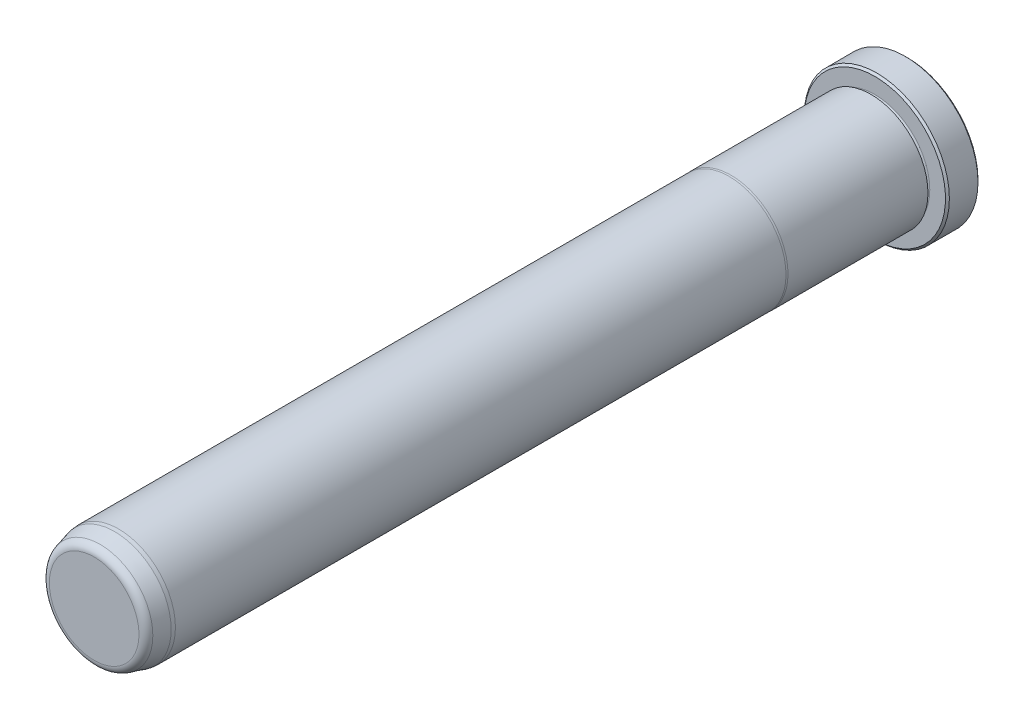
ISO-10303-21;
HEADER;
FILE_DESCRIPTION(('STEP AP214'),'2;1');
FILE_NAME('part.step','',(''),(''),'','','');
FILE_SCHEMA(('AUTOMOTIVE_DESIGN { 1 0 10303 214 1 1 1 1 }'));
ENDSEC;
DATA;
#1=APPLICATION_CONTEXT('core data for automotive mechanical design processes');
#2=APPLICATION_PROTOCOL_DEFINITION('international standard','automotive_design',2000,#1);
#3=PRODUCT_CONTEXT('',#1,'mechanical');
#4=PRODUCT('Part','Part','',(#3));
#5=PRODUCT_RELATED_PRODUCT_CATEGORY('part','',(#4));
#6=PRODUCT_DEFINITION_FORMATION('','',#4);
#7=PRODUCT_DEFINITION_CONTEXT('part definition',#1,'design');
#8=PRODUCT_DEFINITION('design','',#6,#7);
#9=PRODUCT_DEFINITION_SHAPE('','',#8);
#10=(LENGTH_UNIT() NAMED_UNIT(*) SI_UNIT(.MILLI.,.METRE.));
#11=(NAMED_UNIT(*) PLANE_ANGLE_UNIT() SI_UNIT($,.RADIAN.));
#12=(NAMED_UNIT(*) SI_UNIT($,.STERADIAN.) SOLID_ANGLE_UNIT());
#13=UNCERTAINTY_MEASURE_WITH_UNIT(LENGTH_MEASURE(1.E-05),#10,'distance_accuracy_value','');
#14=(GEOMETRIC_REPRESENTATION_CONTEXT(3) GLOBAL_UNCERTAINTY_ASSIGNED_CONTEXT((#13)) GLOBAL_UNIT_ASSIGNED_CONTEXT((#10,
#11,#12)) REPRESENTATION_CONTEXT('',''));
#15=CARTESIAN_POINT('',(0.,0.,0.));
#16=DIRECTION('',(0.,0.,1.));
#17=DIRECTION('',(1.,0.,0.));
#18=AXIS2_PLACEMENT_3D('',#15,#16,#17);
#19=CARTESIAN_POINT('',(0.,0.,0.));
#20=DIRECTION('',(0.,0.,1.));
#21=DIRECTION('',(1.,0.,0.));
#22=AXIS2_PLACEMENT_3D('',#19,#20,#21);
#23=PLANE('',#22);
#24=CARTESIAN_POINT('',(0.,0.,0.));
#25=DIRECTION('',(0.,0.,1.));
#26=DIRECTION('',(1.,0.,0.));
#27=AXIS2_PLACEMENT_3D('',#24,#25,#26);
#28=CIRCLE('',#27,13.7795);
#29=CARTESIAN_POINT('',(13.7795,0.,0.));
#30=VERTEX_POINT('',#29);
#31=EDGE_CURVE('E37',#30,#30,#28,.F.);
#32=ORIENTED_EDGE('',*,*,#31,.T.);
#33=EDGE_LOOP('',(#32));
#34=FACE_BOUND('',#33,.T.);
#35=ADVANCED_FACE('F30',(#34),#23,.F.);
#36=CARTESIAN_POINT('',(0.,0.,0.));
#37=DIRECTION('',(0.,0.,1.));
#38=DIRECTION('',(1.,0.,0.));
#39=AXIS2_PLACEMENT_3D('',#36,#37,#38);
#40=CYLINDRICAL_SURFACE('',#39,14.1605);
#41=CARTESIAN_POINT('',(0.,0.,0.381000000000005));
#42=DIRECTION('',(0.,0.,1.));
#43=DIRECTION('',(1.,0.,0.));
#44=AXIS2_PLACEMENT_3D('',#41,#42,#43);
#45=CIRCLE('',#44,14.1605);
#46=CARTESIAN_POINT('',(14.1605,0.,0.381000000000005));
#47=VERTEX_POINT('',#46);
#48=EDGE_CURVE('E41',#47,#47,#45,.T.);
#49=ORIENTED_EDGE('',*,*,#48,.T.);
#50=EDGE_LOOP('',(#49));
#51=FACE_BOUND('',#50,.T.);
#52=CARTESIAN_POINT('',(0.,0.,5.96900000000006));
#53=DIRECTION('',(0.,0.,-1.));
#54=DIRECTION('',(-1.,0.,0.));
#55=AXIS2_PLACEMENT_3D('',#52,#53,#54);
#56=CIRCLE('',#55,14.1605);
#57=CARTESIAN_POINT('',(-14.1605,0.,5.96900000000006));
#58=VERTEX_POINT('',#57);
#59=EDGE_CURVE('E45',#58,#58,#56,.T.);
#60=ORIENTED_EDGE('',*,*,#59,.T.);
#61=EDGE_LOOP('',(#60));
#62=FACE_BOUND('',#61,.T.);
#63=ADVANCED_FACE('F118',(#51,#62),#40,.T.);
#64=CARTESIAN_POINT('',(0.,14.1605,6.35));
#65=DIRECTION('',(0.,0.,-1.));
#66=DIRECTION('',(-1.,0.,0.));
#67=AXIS2_PLACEMENT_3D('',#64,#65,#66);
#68=PLANE('',#67);
#69=CARTESIAN_POINT('',(0.,0.,6.35));
#70=DIRECTION('',(0.,0.,-1.));
#71=DIRECTION('',(-1.,0.,0.));
#72=AXIS2_PLACEMENT_3D('',#69,#70,#71);
#73=CIRCLE('',#72,13.7795000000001);
#74=CARTESIAN_POINT('',(-13.7795000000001,0.,6.35));
#75=VERTEX_POINT('',#74);
#76=EDGE_CURVE('E10',#75,#75,#73,.F.);
#77=ORIENTED_EDGE('',*,*,#76,.T.);
#78=EDGE_LOOP('',(#77));
#79=FACE_BOUND('',#78,.T.);
#80=CARTESIAN_POINT('',(0.,0.,6.35));
#81=DIRECTION('',(0.,0.,1.));
#82=DIRECTION('',(1.,0.,0.));
#83=AXIS2_PLACEMENT_3D('',#80,#81,#82);
#84=CIRCLE('',#83,10.7188);
#85=CARTESIAN_POINT('',(10.7188,0.,6.35));
#86=VERTEX_POINT('',#85);
#87=EDGE_CURVE('E56',#86,#86,#84,.T.);
#88=ORIENTED_EDGE('',*,*,#87,.F.);
#89=EDGE_LOOP('',(#88));
#90=FACE_BOUND('',#89,.T.);
#91=ADVANCED_FACE('F113',(#79,#90),#68,.F.);
#92=CARTESIAN_POINT('',(0.,0.,6.731));
#93=DIRECTION('',(0.,0.,1.));
#94=DIRECTION('',(1.,0.,0.));
#95=AXIS2_PLACEMENT_3D('',#92,#93,#94);
#96=TOROIDAL_SURFACE('',#95,10.7188,0.381000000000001);
#97=CARTESIAN_POINT('',(0.,0.,7.112));
#98=DIRECTION('',(0.,0.,1.));
#99=DIRECTION('',(1.,0.,0.));
#100=AXIS2_PLACEMENT_3D('',#97,#98,#99);
#101=CIRCLE('',#100,10.7188);
#102=CARTESIAN_POINT('',(10.7188,0.,7.112));
#103=VERTEX_POINT('',#102);
#104=EDGE_CURVE('E59',#103,#103,#101,.T.);
#105=ORIENTED_EDGE('',*,*,#104,.F.);
#106=EDGE_LOOP('',(#105));
#107=FACE_BOUND('',#106,.T.);
#108=ORIENTED_EDGE('',*,*,#87,.T.);
#109=EDGE_LOOP('',(#108));
#110=FACE_BOUND('',#109,.T.);
#111=ADVANCED_FACE('F107',(#107,#110),#96,.F.);
#112=CARTESIAN_POINT('',(0.,10.7188,7.112));
#113=DIRECTION('',(0.,0.,1.));
#114=DIRECTION('',(1.,0.,0.));
#115=AXIS2_PLACEMENT_3D('',#112,#113,#114);
#116=PLANE('',#115);
#117=CARTESIAN_POINT('',(0.,0.,7.112));
#118=DIRECTION('',(0.,0.,1.));
#119=DIRECTION('',(1.,0.,0.));
#120=AXIS2_PLACEMENT_3D('',#117,#118,#119);
#121=CIRCLE('',#120,11.1252);
#122=CARTESIAN_POINT('',(11.1252,0.,7.112));
#123=VERTEX_POINT('',#122);
#124=EDGE_CURVE('E62',#123,#123,#121,.T.);
#125=ORIENTED_EDGE('',*,*,#124,.F.);
#126=EDGE_LOOP('',(#125));
#127=FACE_BOUND('',#126,.T.);
#128=ORIENTED_EDGE('',*,*,#104,.T.);
#129=EDGE_LOOP('',(#128));
#130=FACE_BOUND('',#129,.T.);
#131=ADVANCED_FACE('F101',(#127,#130),#116,.F.);
#132=CARTESIAN_POINT('',(0.,0.,0.));
#133=DIRECTION('',(0.,0.,1.));
#134=DIRECTION('',(1.,0.,0.));
#135=AXIS2_PLACEMENT_3D('',#132,#133,#134);
#136=CYLINDRICAL_SURFACE('',#135,11.1252);
#137=CARTESIAN_POINT('',(0.,0.,34.4347630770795));
#138=DIRECTION('',(0.,0.,1.));
#139=DIRECTION('',(1.,0.,0.));
#140=AXIS2_PLACEMENT_3D('',#137,#138,#139);
#141=CIRCLE('',#140,11.1252);
#142=CARTESIAN_POINT('',(11.1252,0.,34.4347630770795));
#143=VERTEX_POINT('',#142);
#144=EDGE_CURVE('E65',#143,#143,#141,.T.);
#145=ORIENTED_EDGE('',*,*,#144,.F.);
#146=EDGE_LOOP('',(#145));
#147=FACE_BOUND('',#146,.T.);
#148=ORIENTED_EDGE('',*,*,#124,.T.);
#149=EDGE_LOOP('',(#148));
#150=FACE_BOUND('',#149,.T.);
#151=ADVANCED_FACE('F95',(#147,#150),#136,.T.);
#152=CARTESIAN_POINT('',(0.,0.,34.4347630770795));
#153=DIRECTION('',(0.,0.,-1.));
#154=DIRECTION('',(-1.,0.,0.));
#155=AXIS2_PLACEMENT_3D('',#152,#153,#154);
#156=CONICAL_SURFACE('',#155,11.1252,0.0698131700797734);
#157=CARTESIAN_POINT('',(0.,0.,34.798));
#158=DIRECTION('',(0.,0.,1.));
#159=DIRECTION('',(1.,0.,0.));
#160=AXIS2_PLACEMENT_3D('',#157,#158,#159);
#161=CIRCLE('',#160,11.0998);
#162=CARTESIAN_POINT('',(11.0998,0.,34.798));
#163=VERTEX_POINT('',#162);
#164=EDGE_CURVE('E68',#163,#163,#161,.T.);
#165=ORIENTED_EDGE('',*,*,#164,.F.);
#166=EDGE_LOOP('',(#165));
#167=FACE_BOUND('',#166,.T.);
#168=ORIENTED_EDGE('',*,*,#144,.T.);
#169=EDGE_LOOP('',(#168));
#170=FACE_BOUND('',#169,.T.);
#171=ADVANCED_FACE('F89',(#167,#170),#156,.T.);
#172=CARTESIAN_POINT('',(0.,0.,0.));
#173=DIRECTION('',(0.,0.,1.));
#174=DIRECTION('',(1.,0.,0.));
#175=AXIS2_PLACEMENT_3D('',#172,#173,#174);
#176=CYLINDRICAL_SURFACE('',#175,11.0998);
#177=CARTESIAN_POINT('',(0.,0.,153.9875));
#178=DIRECTION('',(0.,0.,1.));
#179=DIRECTION('',(1.,0.,0.));
#180=AXIS2_PLACEMENT_3D('',#177,#178,#179);
#181=CIRCLE('',#180,11.0998);
#182=CARTESIAN_POINT('',(11.0998,0.,153.9875));
#183=VERTEX_POINT('',#182);
#184=EDGE_CURVE('E71',#183,#183,#181,.T.);
#185=ORIENTED_EDGE('',*,*,#184,.F.);
#186=EDGE_LOOP('',(#185));
#187=FACE_BOUND('',#186,.T.);
#188=ORIENTED_EDGE('',*,*,#164,.T.);
#189=EDGE_LOOP('',(#188));
#190=FACE_BOUND('',#189,.T.);
#191=ADVANCED_FACE('F83',(#187,#190),#176,.T.);
#192=CARTESIAN_POINT('',(0.,0.,153.9875));
#193=DIRECTION('',(0.,0.,-1.));
#194=DIRECTION('',(-1.,0.,0.));
#195=AXIS2_PLACEMENT_3D('',#192,#193,#194);
#196=CONICAL_SURFACE('',#195,11.0998,0.0872664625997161);
#197=CARTESIAN_POINT('',(0.,0.,154.7495));
#198=DIRECTION('',(0.,0.,1.));
#199=DIRECTION('',(1.,0.,0.));
#200=AXIS2_PLACEMENT_3D('',#197,#198,#199);
#201=CIRCLE('',#200,11.0331336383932);
#202=CARTESIAN_POINT('',(11.0331336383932,0.,154.7495));
#203=VERTEX_POINT('',#202);
#204=EDGE_CURVE('E74',#203,#203,#201,.T.);
#205=ORIENTED_EDGE('',*,*,#204,.F.);
#206=EDGE_LOOP('',(#205));
#207=FACE_BOUND('',#206,.T.);
#208=ORIENTED_EDGE('',*,*,#184,.T.);
#209=EDGE_LOOP('',(#208));
#210=FACE_BOUND('',#209,.T.);
#211=ADVANCED_FACE('F80',(#207,#210),#196,.T.);
#212=CARTESIAN_POINT('',(0.,0.,154.7495));
#213=DIRECTION('',(0.,0.,-1.));
#214=DIRECTION('',(-1.,0.,0.));
#215=AXIS2_PLACEMENT_3D('',#212,#213,#214);
#216=CONICAL_SURFACE('',#215,11.0331336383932,0.26179938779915);
#217=CARTESIAN_POINT('',(0.,0.,157.5733752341));
#218=DIRECTION('',(0.,0.,1.));
#219=DIRECTION('',(1.,0.,0.));
#220=AXIS2_PLACEMENT_3D('',#217,#218,#219);
#221=CIRCLE('',#220,10.2764785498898);
#222=CARTESIAN_POINT('',(10.2764785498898,0.,157.5733752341));
#223=VERTEX_POINT('',#222);
#224=EDGE_CURVE('E50',#223,#223,#221,.F.);
#225=ORIENTED_EDGE('',*,*,#224,.T.);
#226=EDGE_LOOP('',(#225));
#227=FACE_BOUND('',#226,.T.);
#228=ORIENTED_EDGE('',*,*,#204,.T.);
#229=EDGE_LOOP('',(#228));
#230=FACE_BOUND('',#229,.T.);
#231=ADVANCED_FACE('F78',(#227,#230),#216,.T.);
#232=CARTESIAN_POINT('',(0.,9.96120289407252,158.75));
#233=DIRECTION('',(0.,0.,-1.));
#234=DIRECTION('',(-1.,0.,0.));
#235=AXIS2_PLACEMENT_3D('',#232,#233,#234);
#236=PLANE('',#235);
#237=CARTESIAN_POINT('',(0.,0.,158.75));
#238=DIRECTION('',(0.,0.,-1.));
#239=DIRECTION('',(-1.,0.,0.));
#240=AXIS2_PLACEMENT_3D('',#237,#238,#239);
#241=CIRCLE('',#240,8.74307130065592);
#242=CARTESIAN_POINT('',(-8.74307130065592,0.,158.75));
#243=VERTEX_POINT('',#242);
#244=EDGE_CURVE('E53',#243,#243,#241,.F.);
#245=ORIENTED_EDGE('',*,*,#244,.T.);
#246=EDGE_LOOP('',(#245));
#247=FACE_BOUND('',#246,.T.);
#248=ADVANCED_FACE('F133',(#247),#236,.F.);
#249=CARTESIAN_POINT('',(0.,0.,157.1625));
#250=DIRECTION('',(0.,0.,-1.));
#251=DIRECTION('',(-1.,0.,0.));
#252=AXIS2_PLACEMENT_3D('',#249,#250,#251);
#253=TOROIDAL_SURFACE('',#252,8.74307130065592,1.5875);
#254=ORIENTED_EDGE('',*,*,#224,.F.);
#255=EDGE_LOOP('',(#254));
#256=FACE_BOUND('',#255,.T.);
#257=ORIENTED_EDGE('',*,*,#244,.F.);
#258=EDGE_LOOP('',(#257));
#259=FACE_BOUND('',#258,.T.);
#260=ADVANCED_FACE('F130',(#256,#259),#253,.T.);
#261=CARTESIAN_POINT('',(0.,0.,0.381000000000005));
#262=DIRECTION('',(0.,0.,1.));
#263=DIRECTION('',(1.,0.,0.));
#264=AXIS2_PLACEMENT_3D('',#261,#262,#263);
#265=CONICAL_SURFACE('',#264,14.1605,0.785398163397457);
#266=ORIENTED_EDGE('',*,*,#31,.F.);
#267=EDGE_LOOP('',(#266));
#268=FACE_BOUND('',#267,.T.);
#269=ORIENTED_EDGE('',*,*,#48,.F.);
#270=EDGE_LOOP('',(#269));
#271=FACE_BOUND('',#270,.T.);
#272=ADVANCED_FACE('F132',(#268,#271),#265,.T.);
#273=CARTESIAN_POINT('',(0.,0.,6.35));
#274=DIRECTION('',(0.,0.,-1.));
#275=DIRECTION('',(-1.,0.,0.));
#276=AXIS2_PLACEMENT_3D('',#273,#274,#275);
#277=CONICAL_SURFACE('',#276,13.7795000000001,0.785398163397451);
#278=ORIENTED_EDGE('',*,*,#59,.F.);
#279=EDGE_LOOP('',(#278));
#280=FACE_BOUND('',#279,.T.);
#281=ORIENTED_EDGE('',*,*,#76,.F.);
#282=EDGE_LOOP('',(#281));
#283=FACE_BOUND('',#282,.T.);
#284=ADVANCED_FACE('F32',(#280,#283),#277,.T.);
#285=CLOSED_SHELL('',(#35,#63,#91,#111,#131,#151,#171,#191,#211,#231,#248,#260,#272,#284));
#286=MANIFOLD_SOLID_BREP('B2',#285);
#287=ADVANCED_BREP_SHAPE_REPRESENTATION('',(#18,#286),#14);
#288=SHAPE_DEFINITION_REPRESENTATION(#9,#287);
ENDSEC;
END-ISO-10303-21;
